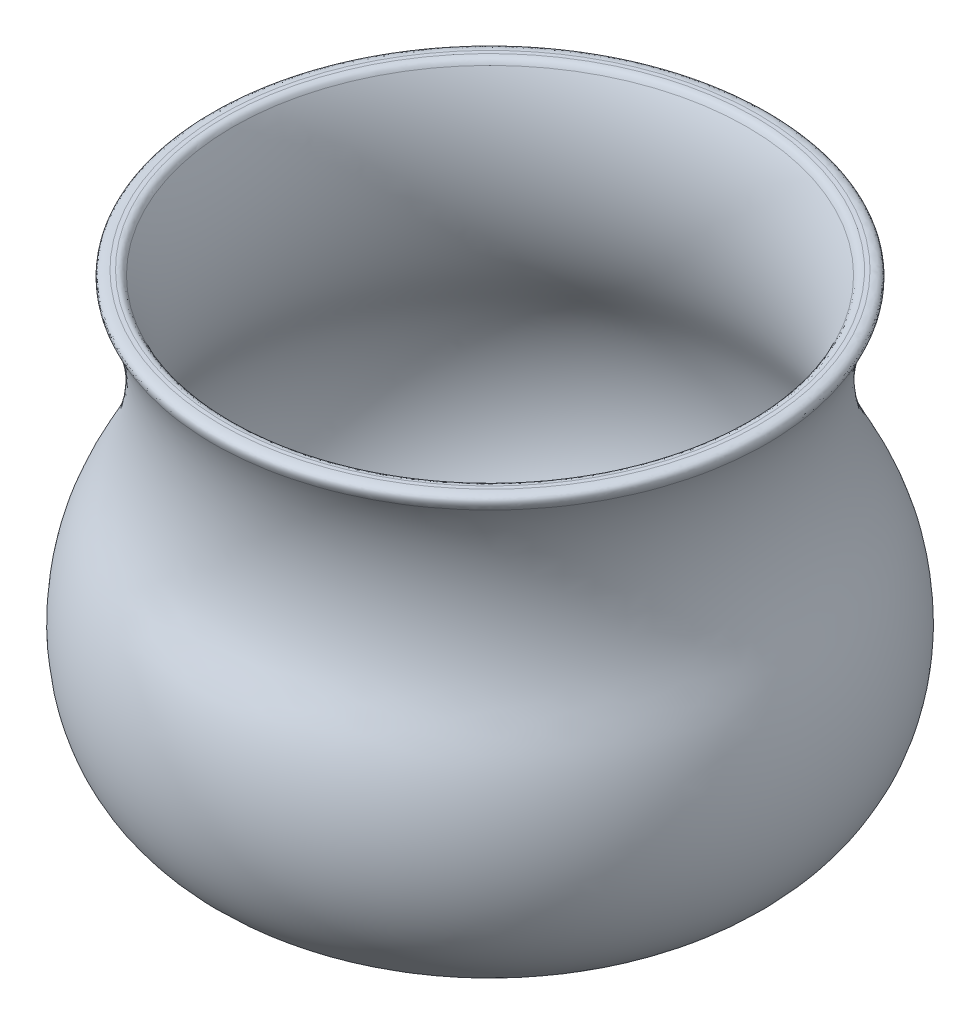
ISO-10303-21;
HEADER;
FILE_DESCRIPTION(('STEP AP214'),'2;1');
FILE_NAME('part.step','',(''),(''),'','','');
FILE_SCHEMA(('AUTOMOTIVE_DESIGN { 1 0 10303 214 1 1 1 1 }'));
ENDSEC;
DATA;
#1=APPLICATION_CONTEXT('core data for automotive mechanical design processes');
#2=APPLICATION_PROTOCOL_DEFINITION('international standard','automotive_design',2000,#1);
#3=PRODUCT_CONTEXT('',#1,'mechanical');
#4=PRODUCT('Part','Part','',(#3));
#5=PRODUCT_RELATED_PRODUCT_CATEGORY('part','',(#4));
#6=PRODUCT_DEFINITION_FORMATION('','',#4);
#7=PRODUCT_DEFINITION_CONTEXT('part definition',#1,'design');
#8=PRODUCT_DEFINITION('design','',#6,#7);
#9=PRODUCT_DEFINITION_SHAPE('','',#8);
#10=(LENGTH_UNIT() NAMED_UNIT(*) SI_UNIT(.MILLI.,.METRE.));
#11=(NAMED_UNIT(*) PLANE_ANGLE_UNIT() SI_UNIT($,.RADIAN.));
#12=(NAMED_UNIT(*) SI_UNIT($,.STERADIAN.) SOLID_ANGLE_UNIT());
#13=UNCERTAINTY_MEASURE_WITH_UNIT(LENGTH_MEASURE(1.E-05),#10,'distance_accuracy_value','');
#14=(GEOMETRIC_REPRESENTATION_CONTEXT(3) GLOBAL_UNCERTAINTY_ASSIGNED_CONTEXT((#13)) GLOBAL_UNIT_ASSIGNED_CONTEXT((#10,
#11,#12)) REPRESENTATION_CONTEXT('',''));
#15=CARTESIAN_POINT('',(0.,0.,0.));
#16=DIRECTION('',(0.,0.,1.));
#17=DIRECTION('',(1.,0.,0.));
#18=AXIS2_PLACEMENT_3D('',#15,#16,#17);
#19=CARTESIAN_POINT('',(-2.59889773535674,17.7798403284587,0.));
#20=CARTESIAN_POINT('',(-3.41804487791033,17.7798418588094,0.));
#21=CARTESIAN_POINT('',(-5.07230125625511,17.7505460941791,0.));
#22=CARTESIAN_POINT('',(-8.2501328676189,17.5837666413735,0.));
#23=CARTESIAN_POINT('',(-12.0715507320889,17.1898060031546,0.));
#24=CARTESIAN_POINT('',(-16.4007658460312,16.4787344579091,0.));
#25=CARTESIAN_POINT('',(-21.8630196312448,15.2934203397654,0.));
#26=CARTESIAN_POINT('',(-28.1522905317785,13.5199401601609,0.));
#27=CARTESIAN_POINT('',(-35.0224513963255,11.388086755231,0.));
#28=CARTESIAN_POINT('',(-41.4078803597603,9.65579886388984,0.));
#29=CARTESIAN_POINT('',(-46.5125739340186,8.80609373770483,0.));
#30=CARTESIAN_POINT('',(-50.60387608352,8.60866084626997,0.));
#31=CARTESIAN_POINT('',(-54.880340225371,8.76169934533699,0.));
#32=CARTESIAN_POINT('',(-59.2432466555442,9.42138384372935,0.));
#33=CARTESIAN_POINT('',(-63.3201399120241,10.5166375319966,0.));
#34=CARTESIAN_POINT('',(-67.0747917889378,11.8603965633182,0.));
#35=CARTESIAN_POINT('',(-71.224968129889,13.9871236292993,0.));
#36=CARTESIAN_POINT('',(-75.433332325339,17.16563538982,0.));
#37=CARTESIAN_POINT('',(-80.1260458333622,22.1689867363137,0.));
#38=CARTESIAN_POINT('',(-84.3963817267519,29.7618481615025,0.));
#39=CARTESIAN_POINT('',(-87.0319074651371,40.4877583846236,0.));
#40=CARTESIAN_POINT('',(-87.1537159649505,50.081833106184,0.));
#41=CARTESIAN_POINT('',(-86.0731256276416,57.6818552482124,0.));
#42=CARTESIAN_POINT('',(-84.6987571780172,63.2298898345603,0.));
#43=CARTESIAN_POINT('',(-83.12055382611,67.6140246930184,0.));
#44=CARTESIAN_POINT('',(-81.597644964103,70.9529731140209,0.));
#45=CARTESIAN_POINT('',(-79.863348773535,74.4015743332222,0.));
#46=CARTESIAN_POINT('',(-77.9359946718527,78.0278609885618,0.));
#47=CARTESIAN_POINT('',(-76.0507539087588,82.0156497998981,0.));
#48=CARTESIAN_POINT('',(-74.3303302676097,86.2588847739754,0.));
#49=CARTESIAN_POINT('',(-72.6471377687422,91.7262697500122,0.));
#50=CARTESIAN_POINT('',(-70.8919716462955,100.791121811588,0.));
#51=CARTESIAN_POINT('',(-70.4966893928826,112.42752007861,0.));
#52=CARTESIAN_POINT('',(-72.6077926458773,123.852833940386,0.));
#53=CARTESIAN_POINT('',(-75.9245220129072,132.446805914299,0.));
#54=CARTESIAN_POINT('',(-78.1616508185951,136.496191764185,0.));
#55=CARTESIAN_POINT('',(-79.4218922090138,138.422639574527,0.));
#56=B_SPLINE_CURVE_WITH_KNOTS('',3,(#19,#20,#21,#22,#23,#24,#25,#26,#27,#28,#29,#30,#31,#32,#33,
#34,#35,#36,#37,#38,#39,#40,#41,#42,#43,#44,#45,#46,#47,#48,#49,#50,#51,#52,#53,#54,#55),
.UNSPECIFIED.,.F.,.F.,(4,1,1,1,1,1,1,1,1,1,1,1,1,1,1,1,1,1,1,1,1,1,1,1,1,1,1,1,1,1,1,1,1,1,4),
(0.0286279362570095,0.0362167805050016,0.0438056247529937,0.058983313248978,0.0741610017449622,
0.0893386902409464,0.119694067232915,0.150049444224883,0.180404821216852,0.21076019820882,
0.225937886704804,0.241115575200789,0.271470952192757,0.286648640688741,0.301826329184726,
0.332181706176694,0.362537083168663,0.392892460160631,0.453603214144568,0.514313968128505,
0.575024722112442,0.60538009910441,0.635735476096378,0.666090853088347,0.681268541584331,
0.696446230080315,0.726801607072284,0.741979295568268,0.757156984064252,0.787512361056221,
0.817867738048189,0.878578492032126,0.939289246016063,0.969644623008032,1.),.UNSPECIFIED.);
#57=CARTESIAN_POINT('',(-2.59889773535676,11.7798403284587,0.));
#58=DIRECTION('',(0.,-1.,0.));
#59=AXIS1_PLACEMENT('',#57,#58);
#60=SURFACE_OF_REVOLUTION('',#56,#59);
#61=CARTESIAN_POINT('',(-2.59889773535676,133.763884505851,0.));
#62=DIRECTION('',(0.,1.,0.));
#63=DIRECTION('',(0.,0.,-1.));
#64=AXIS2_PLACEMENT_3D('',#61,#62,#63);
#65=CIRCLE('',#64,74.1396984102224);
#66=CARTESIAN_POINT('',(-2.59889773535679,133.763884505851,-74.1396984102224));
#67=VERTEX_POINT('',#66);
#68=EDGE_CURVE('E49',#67,#67,#65,.T.);
#69=ORIENTED_EDGE('',*,*,#68,.T.);
#70=EDGE_LOOP('',(#69));
#71=FACE_BOUND('',#70,.T.);
#72=CARTESIAN_POINT('',(-2.59889773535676,17.7798403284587,0.));
#73=VERTEX_POINT('',#72);
#74=VERTEX_LOOP('',#73);
#75=FACE_BOUND('',#74,.T.);
#76=ADVANCED_FACE('F35',(#71,#75),#60,.T.);
#77=CARTESIAN_POINT('',(-84.4431738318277,135.137836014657,0.));
#78=CARTESIAN_POINT('',(-75.1954533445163,121.001513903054,0.));
#79=CARTESIAN_POINT('',(-74.4515854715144,94.7754784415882,0.));
#80=CARTESIAN_POINT('',(-99.1031649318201,54.6230183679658,0.));
#81=CARTESIAN_POINT('',(-92.9540964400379,8.32388203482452,0.));
#82=CARTESIAN_POINT('',(-38.6971228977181,0.0087223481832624,0.));
#83=CARTESIAN_POINT('',(-21.937007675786,11.7798403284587,0.));
#84=CARTESIAN_POINT('',(-2.59889773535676,11.7798403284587,0.));
#85=B_SPLINE_CURVE_WITH_KNOTS('',3,(#77,#78,#79,#80,#81,#82,#83,#84),.UNSPECIFIED.,.F.,.F.,(4,1,
1,1,1,4),(0.0286279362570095,0.28359965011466,0.35927823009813,0.738065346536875,
0.806872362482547,1.),.UNSPECIFIED.);
#86=CARTESIAN_POINT('',(-2.59889773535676,11.7798403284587,0.));
#87=DIRECTION('',(0.,-1.,0.));
#88=AXIS1_PLACEMENT('',#86,#87);
#89=SURFACE_OF_REVOLUTION('',#85,#88);
#90=CARTESIAN_POINT('',(-2.59889773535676,131.487508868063,0.));
#91=DIRECTION('',(0.,-1.,0.));
#92=DIRECTION('',(0.,0.,-1.));
#93=AXIS2_PLACEMENT_3D('',#90,#91,#92);
#94=CIRCLE('',#93,79.7145582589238);
#95=CARTESIAN_POINT('',(-2.59889773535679,131.487508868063,-79.7145582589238));
#96=VERTEX_POINT('',#95);
#97=EDGE_CURVE('E11',#96,#96,#94,.T.);
#98=ORIENTED_EDGE('',*,*,#97,.T.);
#99=EDGE_LOOP('',(#98));
#100=FACE_BOUND('',#99,.T.);
#101=CARTESIAN_POINT('',(-2.59889773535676,11.7798403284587,0.));
#102=VERTEX_POINT('',#101);
#103=VERTEX_LOOP('',#102);
#104=FACE_BOUND('',#103,.T.);
#105=ADVANCED_FACE('F55',(#100,#104),#89,.T.);
#106=CARTESIAN_POINT('',(-84.4431738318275,135.137836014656,0.));
#107=DIRECTION('',(0.,-1.,0.));
#108=DIRECTION('',(0.,0.,-1.));
#109=AXIS2_PLACEMENT_3D('',#106,#107,#108);
#110=PLANE('',#109);
#111=CARTESIAN_POINT('',(-2.59889773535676,135.137836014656,-76.3717411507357));
#112=CARTESIAN_POINT('',(-3.84838875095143,135.137836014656,-76.3717420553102));
#113=CARTESIAN_POINT('',(-5.09785383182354,135.137836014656,-76.3406731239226));
#114=CARTESIAN_POINT('',(-7.59381208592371,135.137836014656,-76.2169967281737));
#115=CARTESIAN_POINT('',(-8.84030507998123,135.137836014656,-76.1243856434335));
#116=CARTESIAN_POINT('',(-11.3273367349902,135.137836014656,-75.8782177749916));
#117=CARTESIAN_POINT('',(-12.5678749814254,135.137836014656,-75.724656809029));
#118=CARTESIAN_POINT('',(-15.0400326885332,135.137836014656,-75.3571799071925));
#119=CARTESIAN_POINT('',(-16.2716517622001,135.137836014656,-75.1432613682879));
#120=CARTESIAN_POINT('',(-18.7230013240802,135.137836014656,-74.6556576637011));
#121=CARTESIAN_POINT('',(-19.9427318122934,135.137836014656,-74.3819724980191));
#122=CARTESIAN_POINT('',(-22.3673355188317,135.137836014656,-73.7754228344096));
#123=CARTESIAN_POINT('',(-23.572209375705,135.137836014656,-73.4425608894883));
#124=CARTESIAN_POINT('',(-25.9641294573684,135.137836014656,-72.7182454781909));
#125=CARTESIAN_POINT('',(-27.1511768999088,135.137836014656,-72.3267960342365));
#126=CARTESIAN_POINT('',(-29.504477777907,135.137836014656,-71.485892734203));
#127=CARTESIAN_POINT('',(-30.670732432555,135.137836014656,-71.0364422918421));
#128=CARTESIAN_POINT('',(-32.9794631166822,135.137836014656,-70.0801347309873));
#129=CARTESIAN_POINT('',(-34.1219391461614,135.137836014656,-69.5732776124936));
#130=CARTESIAN_POINT('',(-36.3805825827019,135.137836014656,-68.5038510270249));
#131=CARTESIAN_POINT('',(-37.4967484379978,135.137836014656,-67.9412782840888));
#132=CARTESIAN_POINT('',(-39.7002596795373,135.137836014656,-66.7621037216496));
#133=CARTESIAN_POINT('',(-40.7876030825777,135.137836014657,-66.1454981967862));
#134=CARTESIAN_POINT('',(-42.9309522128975,135.137836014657,-64.8599398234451));
#135=CARTESIAN_POINT('',(-43.9869565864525,135.137836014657,-64.1909847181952));
#136=CARTESIAN_POINT('',(-46.0651102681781,135.137836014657,-62.8024068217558));
#137=CARTESIAN_POINT('',(-47.0872595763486,135.137836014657,-62.0827840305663));
#138=CARTESIAN_POINT('',(-49.0951848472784,135.137836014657,-60.5945495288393));
#139=CARTESIAN_POINT('',(-50.0809623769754,135.137836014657,-59.8259399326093));
#140=CARTESIAN_POINT('',(-52.0136248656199,135.137836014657,-58.2414115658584));
#141=CARTESIAN_POINT('',(-52.960512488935,135.137836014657,-57.4254960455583));
#142=CARTESIAN_POINT('',(-54.8128792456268,135.137836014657,-55.7480334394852));
#143=CARTESIAN_POINT('',(-55.718360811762,135.137836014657,-54.8864890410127));
#144=CARTESIAN_POINT('',(-57.4853867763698,135.137836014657,-53.1194630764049));
#145=CARTESIAN_POINT('',(-58.3469311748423,135.137836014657,-52.2139815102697));
#146=CARTESIAN_POINT('',(-60.0243937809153,135.137836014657,-50.3616147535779));
#147=CARTESIAN_POINT('',(-60.8403093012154,135.137836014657,-49.4147271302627));
#148=CARTESIAN_POINT('',(-62.4248376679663,135.137836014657,-47.4820646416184));
#149=CARTESIAN_POINT('',(-63.1934472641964,135.137836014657,-46.4962871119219));
#150=CARTESIAN_POINT('',(-64.6816817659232,135.137836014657,-44.488361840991));
#151=CARTESIAN_POINT('',(-65.4013045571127,135.137836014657,-43.4662125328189));
#152=CARTESIAN_POINT('',(-66.7898824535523,135.137836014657,-41.3880588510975));
#153=CARTESIAN_POINT('',(-67.4588375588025,135.137836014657,-40.332054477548));
#154=CARTESIAN_POINT('',(-68.7443959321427,135.137836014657,-38.188705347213));
#155=CARTESIAN_POINT('',(-69.3610014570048,135.137836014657,-37.1013619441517));
#156=CARTESIAN_POINT('',(-70.5401760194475,135.137836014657,-34.8978507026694));
#157=CARTESIAN_POINT('',(-71.1027487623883,135.137836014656,-33.7816848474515));
#158=CARTESIAN_POINT('',(-72.172175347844,135.137836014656,-31.5230414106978));
#159=CARTESIAN_POINT('',(-72.6790324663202,135.137836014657,-30.3805653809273));
#160=CARTESIAN_POINT('',(-73.635340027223,135.137836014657,-28.0718346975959));
#161=CARTESIAN_POINT('',(-74.0847904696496,135.137836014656,-26.9055800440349));
#162=CARTESIAN_POINT('',(-74.9256937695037,135.137836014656,-24.5522791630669));
#163=CARTESIAN_POINT('',(-75.317143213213,135.137836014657,-23.3652317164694));
#164=CARTESIAN_POINT('',(-76.04145862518,135.137836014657,-20.9733116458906));
#165=CARTESIAN_POINT('',(-76.374320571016,135.137836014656,-19.7684378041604));
#166=CARTESIAN_POINT('',(-76.9808702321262,135.137836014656,-17.3438340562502));
#167=CARTESIAN_POINT('',(-77.2545553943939,135.137836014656,-16.124103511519));
#168=CARTESIAN_POINT('',(-77.7421591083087,135.137836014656,-13.6727541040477));
#169=CARTESIAN_POINT('',(-77.9560776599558,135.137836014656,-12.4411352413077));
#170=CARTESIAN_POINT('',(-78.32355452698,135.137836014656,-9.96897695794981));
#171=CARTESIAN_POINT('',(-78.4771154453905,135.137836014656,-8.72843792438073));
#172=CARTESIAN_POINT('',(-78.7232834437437,135.137836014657,-6.24140841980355));
#173=CARTESIAN_POINT('',(-78.815894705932,135.137836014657,-4.99491836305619));
#174=CARTESIAN_POINT('',(-78.9395706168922,135.137836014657,-2.49895208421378));
#175=CARTESIAN_POINT('',(-78.9706388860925,135.137836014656,-1.24947604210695));
#176=CARTESIAN_POINT('',(-78.9706388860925,135.137836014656,1.24947604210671));
#177=CARTESIAN_POINT('',(-78.9395706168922,135.137836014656,2.49895208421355));
#178=CARTESIAN_POINT('',(-78.8158947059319,135.137836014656,4.99491836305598));
#179=CARTESIAN_POINT('',(-78.7232834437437,135.137836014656,6.24140841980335));
#180=CARTESIAN_POINT('',(-78.4771154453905,135.137836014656,8.72843792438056));
#181=CARTESIAN_POINT('',(-78.32355452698,135.137836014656,9.96897695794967));
#182=CARTESIAN_POINT('',(-77.9560776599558,135.137836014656,12.4411352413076));
#183=CARTESIAN_POINT('',(-77.7421591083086,135.137836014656,13.6727541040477));
#184=CARTESIAN_POINT('',(-77.2545553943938,135.137836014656,16.1241035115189));
#185=CARTESIAN_POINT('',(-76.9808702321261,135.137836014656,17.3438340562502));
#186=CARTESIAN_POINT('',(-76.374320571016,135.137836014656,19.7684378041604));
#187=CARTESIAN_POINT('',(-76.0414586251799,135.137836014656,20.9733116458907));
#188=CARTESIAN_POINT('',(-75.3171432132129,135.137836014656,23.3652317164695));
#189=CARTESIAN_POINT('',(-74.9256937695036,135.137836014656,24.5522791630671));
#190=CARTESIAN_POINT('',(-74.0847904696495,135.137836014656,26.9055800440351));
#191=CARTESIAN_POINT('',(-73.6353400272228,135.137836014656,28.0718346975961));
#192=CARTESIAN_POINT('',(-72.6790324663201,135.137836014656,30.3805653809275));
#193=CARTESIAN_POINT('',(-72.1721753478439,135.137836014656,31.523041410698));
#194=CARTESIAN_POINT('',(-71.1027487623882,135.137836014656,33.7816848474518));
#195=CARTESIAN_POINT('',(-70.5401760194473,135.137836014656,34.8978507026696));
#196=CARTESIAN_POINT('',(-69.3610014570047,135.137836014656,37.1013619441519));
#197=CARTESIAN_POINT('',(-68.7443959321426,135.137836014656,38.1887053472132));
#198=CARTESIAN_POINT('',(-67.4588375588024,135.137836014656,40.3320544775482));
#199=CARTESIAN_POINT('',(-66.7898824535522,135.137836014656,41.3880588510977));
#200=CARTESIAN_POINT('',(-65.4013045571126,135.137836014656,43.4662125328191));
#201=CARTESIAN_POINT('',(-64.6816817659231,135.137836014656,44.4883618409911));
#202=CARTESIAN_POINT('',(-63.1934472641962,135.137836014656,46.496287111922));
#203=CARTESIAN_POINT('',(-62.4248376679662,135.137836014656,47.4820646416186));
#204=CARTESIAN_POINT('',(-60.8403093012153,135.137836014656,49.4147271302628));
#205=CARTESIAN_POINT('',(-60.0243937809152,135.137836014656,50.361614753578));
#206=CARTESIAN_POINT('',(-58.3469311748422,135.137836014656,52.2139815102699));
#207=CARTESIAN_POINT('',(-57.4853867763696,135.137836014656,53.119463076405));
#208=CARTESIAN_POINT('',(-55.7183608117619,135.137836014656,54.8864890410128));
#209=CARTESIAN_POINT('',(-54.8128792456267,135.137836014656,55.7480334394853));
#210=CARTESIAN_POINT('',(-52.9605124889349,135.137836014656,57.4254960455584));
#211=CARTESIAN_POINT('',(-52.0136248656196,135.137836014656,58.2414115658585));
#212=CARTESIAN_POINT('',(-50.0809623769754,135.137836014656,59.8259399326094));
#213=CARTESIAN_POINT('',(-49.0951848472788,135.137836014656,60.5945495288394));
#214=CARTESIAN_POINT('',(-47.0872595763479,135.137836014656,62.0827840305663));
#215=CARTESIAN_POINT('',(-46.0651102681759,135.137836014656,62.8024068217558));
#216=CARTESIAN_POINT('',(-43.9869565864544,135.137836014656,64.1909847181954));
#217=CARTESIAN_POINT('',(-42.9309522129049,135.137836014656,64.8599398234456));
#218=CARTESIAN_POINT('',(-40.7876030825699,135.137836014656,66.1454981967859));
#219=CARTESIAN_POINT('',(-39.7002596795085,135.137836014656,66.762103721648));
#220=CARTESIAN_POINT('',(-37.4967484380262,135.137836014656,67.9412782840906));
#221=CARTESIAN_POINT('',(-36.3805825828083,135.137836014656,68.5038510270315));
#222=CARTESIAN_POINT('',(-34.1219391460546,135.137836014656,69.5732776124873));
#223=CARTESIAN_POINT('',(-32.9794631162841,135.137836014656,70.0801347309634));
#224=CARTESIAN_POINT('',(-30.6707324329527,135.137836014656,71.0364422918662));
#225=CARTESIAN_POINT('',(-29.5044777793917,135.137836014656,71.4858927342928));
#226=CARTESIAN_POINT('',(-27.1511768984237,135.137836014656,72.3267960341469));
#227=CARTESIAN_POINT('',(-25.9641294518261,135.137836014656,72.7182454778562));
#228=CARTESIAN_POINT('',(-23.5722093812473,135.137836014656,73.4425608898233));
#229=CARTESIAN_POINT('',(-22.3673355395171,135.137836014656,73.7754228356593));
#230=CARTESIAN_POINT('',(-19.9427317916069,135.137836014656,74.3819724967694));
#231=CARTESIAN_POINT('',(-18.7230012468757,135.137836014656,74.6556576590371));
#232=CARTESIAN_POINT('',(-16.2716518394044,135.137836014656,75.143261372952));
#233=CARTESIAN_POINT('',(-15.0400329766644,135.137836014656,75.3571799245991));
#234=CARTESIAN_POINT('',(-12.5678746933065,135.137836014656,75.7246567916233));
#235=CARTESIAN_POINT('',(-11.3273356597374,135.137836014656,75.8782177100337));
#236=CARTESIAN_POINT('',(-8.84030615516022,135.137836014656,76.1243857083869));
#237=CARTESIAN_POINT('',(-7.59381609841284,135.137836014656,76.2169969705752));
#238=CARTESIAN_POINT('',(-5.09784981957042,135.137836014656,76.3406728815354));
#239=CARTESIAN_POINT('',(-3.84837377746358,135.137836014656,76.3717411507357));
#240=CARTESIAN_POINT('',(-1.34942169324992,135.137836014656,76.3717411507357));
#241=CARTESIAN_POINT('',(-0.0999456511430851,135.137836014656,76.3406728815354));
#242=CARTESIAN_POINT('',(2.39602062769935,135.137836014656,76.2169969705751));
#243=CARTESIAN_POINT('',(3.64251068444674,135.137836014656,76.1243857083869));
#244=CARTESIAN_POINT('',(6.12954018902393,135.137836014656,75.8782177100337));
#245=CARTESIAN_POINT('',(7.37007922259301,135.137836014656,75.7246567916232));
#246=CARTESIAN_POINT('',(9.84223750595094,135.137836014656,75.357179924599));
#247=CARTESIAN_POINT('',(11.073856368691,135.137836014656,75.1432613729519));
#248=CARTESIAN_POINT('',(13.5252057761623,135.137836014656,74.655657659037));
#249=CARTESIAN_POINT('',(14.7449363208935,135.137836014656,74.3819724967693));
#250=CARTESIAN_POINT('',(17.1695400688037,135.137836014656,73.7754228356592));
#251=CARTESIAN_POINT('',(18.374413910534,135.137836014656,73.4425608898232));
#252=CARTESIAN_POINT('',(20.7663339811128,135.137836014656,72.7182454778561));
#253=CARTESIAN_POINT('',(21.9533814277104,135.137836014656,72.3267960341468));
#254=CARTESIAN_POINT('',(24.3066823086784,135.137836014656,71.4858927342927));
#255=CARTESIAN_POINT('',(25.4729369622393,135.137836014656,71.0364422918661));
#256=CARTESIAN_POINT('',(27.7816676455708,135.137836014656,70.0801347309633));
#257=CARTESIAN_POINT('',(28.9241436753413,135.137836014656,69.5732776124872));
#258=CARTESIAN_POINT('',(31.182787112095,135.137836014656,68.5038510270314));
#259=CARTESIAN_POINT('',(32.2989529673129,135.137836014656,67.9412782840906));
#260=CARTESIAN_POINT('',(34.5024642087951,135.137836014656,66.7621037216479));
#261=CARTESIAN_POINT('',(35.5898076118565,135.137836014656,66.1454981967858));
#262=CARTESIAN_POINT('',(37.7331567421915,135.137836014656,64.8599398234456));
#263=CARTESIAN_POINT('',(38.7891611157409,135.137836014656,64.1909847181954));
#264=CARTESIAN_POINT('',(40.8673147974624,135.137836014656,62.8024068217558));
#265=CARTESIAN_POINT('',(41.8894641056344,135.137836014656,62.0827840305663));
#266=CARTESIAN_POINT('',(43.8973893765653,135.137836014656,60.5945495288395));
#267=CARTESIAN_POINT('',(44.8831669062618,135.137836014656,59.8259399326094));
#268=CARTESIAN_POINT('',(46.815829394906,135.137836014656,58.2414115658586));
#269=CARTESIAN_POINT('',(47.7627170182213,135.137836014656,57.4254960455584));
#270=CARTESIAN_POINT('',(49.6150837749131,135.137836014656,55.7480334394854));
#271=CARTESIAN_POINT('',(50.5205653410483,135.137836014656,54.8864890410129));
#272=CARTESIAN_POINT('',(52.287591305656,135.137836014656,53.1194630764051));
#273=CARTESIAN_POINT('',(53.1491357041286,135.137836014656,52.2139815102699));
#274=CARTESIAN_POINT('',(54.8265983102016,135.137836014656,50.3616147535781));
#275=CARTESIAN_POINT('',(55.6425138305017,135.137836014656,49.4147271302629));
#276=CARTESIAN_POINT('',(57.2270421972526,135.137836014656,47.4820646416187));
#277=CARTESIAN_POINT('',(57.9956517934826,135.137836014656,46.4962871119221));
#278=CARTESIAN_POINT('',(59.4838862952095,135.137836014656,44.4883618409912));
#279=CARTESIAN_POINT('',(60.203509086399,135.137836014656,43.4662125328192));
#280=CARTESIAN_POINT('',(61.5920869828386,135.137836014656,41.3880588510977));
#281=CARTESIAN_POINT('',(62.2610420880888,135.137836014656,40.3320544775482));
#282=CARTESIAN_POINT('',(63.5466004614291,135.137836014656,38.1887053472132));
#283=CARTESIAN_POINT('',(64.1632059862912,135.137836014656,37.1013619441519));
#284=CARTESIAN_POINT('',(65.3423805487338,135.137836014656,34.8978507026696));
#285=CARTESIAN_POINT('',(65.9049532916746,135.137836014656,33.7816848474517));
#286=CARTESIAN_POINT('',(66.9743798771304,135.137836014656,31.523041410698));
#287=CARTESIAN_POINT('',(67.4812369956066,135.137836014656,30.3805653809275));
#288=CARTESIAN_POINT('',(68.4375445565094,135.137836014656,28.071834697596));
#289=CARTESIAN_POINT('',(68.886994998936,135.137836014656,26.9055800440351));
#290=CARTESIAN_POINT('',(69.7278982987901,135.137836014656,24.552279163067));
#291=CARTESIAN_POINT('',(70.1193477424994,135.137836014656,23.3652317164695));
#292=CARTESIAN_POINT('',(70.8436631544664,135.137836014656,20.9733116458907));
#293=CARTESIAN_POINT('',(71.1765251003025,135.137836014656,19.7684378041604));
#294=CARTESIAN_POINT('',(71.7830747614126,135.137836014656,17.3438340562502));
#295=CARTESIAN_POINT('',(72.0567599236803,135.137836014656,16.124103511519));
#296=CARTESIAN_POINT('',(72.5443636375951,135.137836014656,13.6727541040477));
#297=CARTESIAN_POINT('',(72.7582821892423,135.137836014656,12.4411352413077));
#298=CARTESIAN_POINT('',(73.1257590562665,135.137836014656,9.96897695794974));
#299=CARTESIAN_POINT('',(73.2793199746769,135.137836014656,8.72843792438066));
#300=CARTESIAN_POINT('',(73.5254879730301,135.137836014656,6.24140841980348));
#301=CARTESIAN_POINT('',(73.6180992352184,135.137836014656,4.9949183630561));
#302=CARTESIAN_POINT('',(73.7417751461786,135.137836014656,2.49895208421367));
#303=CARTESIAN_POINT('',(73.772843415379,135.137836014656,1.24947604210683));
#304=CARTESIAN_POINT('',(73.772843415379,135.137836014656,-1.24947604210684));
#305=CARTESIAN_POINT('',(73.7417751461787,135.137836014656,-2.49895208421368));
#306=CARTESIAN_POINT('',(73.6180992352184,135.137836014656,-4.99491836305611));
#307=CARTESIAN_POINT('',(73.5254879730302,135.137836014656,-6.24140841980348));
#308=CARTESIAN_POINT('',(73.2793199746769,135.137836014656,-8.72843792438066));
#309=CARTESIAN_POINT('',(73.1257590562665,135.137836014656,-9.96897695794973));
#310=CARTESIAN_POINT('',(72.7582821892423,135.137836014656,-12.4411352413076));
#311=CARTESIAN_POINT('',(72.5443636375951,135.137836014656,-13.6727541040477));
#312=CARTESIAN_POINT('',(72.0567599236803,135.137836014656,-16.1241035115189));
#313=CARTESIAN_POINT('',(71.7830747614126,135.137836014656,-17.3438340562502));
#314=CARTESIAN_POINT('',(71.1765251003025,135.137836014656,-19.7684378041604));
#315=CARTESIAN_POINT('',(70.8436631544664,135.137836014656,-20.9733116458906));
#316=CARTESIAN_POINT('',(70.1193477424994,135.137836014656,-23.3652317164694));
#317=CARTESIAN_POINT('',(69.7278982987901,135.137836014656,-24.552279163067));
#318=CARTESIAN_POINT('',(68.886994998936,135.137836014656,-26.905580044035));
#319=CARTESIAN_POINT('',(68.4375445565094,135.137836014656,-28.071834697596));
#320=CARTESIAN_POINT('',(67.4812369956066,135.137836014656,-30.3805653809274));
#321=CARTESIAN_POINT('',(66.9743798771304,135.137836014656,-31.5230414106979));
#322=CARTESIAN_POINT('',(65.9049532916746,135.137836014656,-33.7816848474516));
#323=CARTESIAN_POINT('',(65.3423805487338,135.137836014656,-34.8978507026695));
#324=CARTESIAN_POINT('',(64.1632059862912,135.137836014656,-37.1013619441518));
#325=CARTESIAN_POINT('',(63.5466004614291,135.137836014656,-38.1887053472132));
#326=CARTESIAN_POINT('',(62.2610420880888,135.137836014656,-40.3320544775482));
#327=CARTESIAN_POINT('',(61.5920869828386,135.137836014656,-41.3880588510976));
#328=CARTESIAN_POINT('',(60.203509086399,135.137836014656,-43.4662125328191));
#329=CARTESIAN_POINT('',(59.4838862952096,135.137836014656,-44.4883618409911));
#330=CARTESIAN_POINT('',(57.9956517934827,135.137836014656,-46.4962871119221));
#331=CARTESIAN_POINT('',(57.2270421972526,135.137836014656,-47.4820646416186));
#332=CARTESIAN_POINT('',(55.6425138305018,135.137836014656,-49.4147271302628));
#333=CARTESIAN_POINT('',(54.8265983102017,135.137836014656,-50.3616147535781));
#334=CARTESIAN_POINT('',(53.1491357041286,135.137836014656,-52.2139815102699));
#335=CARTESIAN_POINT('',(52.2875913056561,135.137836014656,-53.1194630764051));
#336=CARTESIAN_POINT('',(50.5205653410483,135.137836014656,-54.8864890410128));
#337=CARTESIAN_POINT('',(49.6150837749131,135.137836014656,-55.7480334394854));
#338=CARTESIAN_POINT('',(47.7627170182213,135.137836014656,-57.4254960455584));
#339=CARTESIAN_POINT('',(46.8158293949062,135.137836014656,-58.2414115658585));
#340=CARTESIAN_POINT('',(44.8831669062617,135.137836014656,-59.8259399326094));
#341=CARTESIAN_POINT('',(43.8973893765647,135.137836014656,-60.5945495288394));
#342=CARTESIAN_POINT('',(41.8894641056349,135.137836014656,-62.0827840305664));
#343=CARTESIAN_POINT('',(40.8673147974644,135.137836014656,-62.8024068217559));
#344=CARTESIAN_POINT('',(38.7891611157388,135.137836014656,-64.1909847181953));
#345=CARTESIAN_POINT('',(37.7331567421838,135.137836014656,-64.8599398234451));
#346=CARTESIAN_POINT('',(35.5898076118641,135.137836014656,-66.1454981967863));
#347=CARTESIAN_POINT('',(34.5024642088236,135.137836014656,-66.7621037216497));
#348=CARTESIAN_POINT('',(32.2989529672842,135.137836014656,-67.9412782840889));
#349=CARTESIAN_POINT('',(31.1827871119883,135.137836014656,-68.503851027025));
#350=CARTESIAN_POINT('',(28.9241436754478,135.137836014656,-69.5732776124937));
#351=CARTESIAN_POINT('',(27.7816676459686,135.137836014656,-70.0801347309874));
#352=CARTESIAN_POINT('',(25.4729369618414,135.137836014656,-71.0364422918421));
#353=CARTESIAN_POINT('',(24.3066823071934,135.137836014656,-71.4858927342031));
#354=CARTESIAN_POINT('',(21.9533814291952,135.137836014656,-72.3267960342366));
#355=CARTESIAN_POINT('',(20.7663339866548,135.137836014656,-72.718245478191));
#356=CARTESIAN_POINT('',(18.3744139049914,135.137836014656,-73.4425608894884));
#357=CARTESIAN_POINT('',(17.1695400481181,135.137836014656,-73.7754228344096));
#358=CARTESIAN_POINT('',(14.7449363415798,135.137836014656,-74.3819724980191));
#359=CARTESIAN_POINT('',(13.5252058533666,135.137836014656,-74.6556576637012));
#360=CARTESIAN_POINT('',(11.0738562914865,135.137836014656,-75.1432613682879));
#361=CARTESIAN_POINT('',(9.84223721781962,135.137836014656,-75.3571799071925));
#362=CARTESIAN_POINT('',(7.37007951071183,135.137836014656,-75.724656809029));
#363=CARTESIAN_POINT('',(6.1295412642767,135.137836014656,-75.8782177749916));
#364=CARTESIAN_POINT('',(3.64250960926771,135.137836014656,-76.1243856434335));
#365=CARTESIAN_POINT('',(2.39601661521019,135.137836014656,-76.2169967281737));
#366=CARTESIAN_POINT('',(-0.0999416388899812,135.137836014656,-76.3406731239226));
#367=CARTESIAN_POINT('',(-1.34940671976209,135.137836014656,-76.3717420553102));
#368=CARTESIAN_POINT('',(-2.59889773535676,135.137836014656,-76.3717411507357));
#369=B_SPLINE_CURVE_WITH_KNOTS('',3,(#111,#112,#113,#114,#115,#116,#117,#118,#119,#120,#121,
#122,#123,#124,#125,#126,#127,#128,#129,#130,#131,#132,#133,#134,#135,#136,#137,#138,#139,#140,
#141,#142,#143,#144,#145,#146,#147,#148,#149,#150,#151,#152,#153,#154,#155,#156,#157,#158,#159,
#160,#161,#162,#163,#164,#165,#166,#167,#168,#169,#170,#171,#172,#173,#174,#175,#176,#177,#178,
#179,#180,#181,#182,#183,#184,#185,#186,#187,#188,#189,#190,#191,#192,#193,#194,#195,#196,#197,
#198,#199,#200,#201,#202,#203,#204,#205,#206,#207,#208,#209,#210,#211,#212,#213,#214,#215,#216,
#217,#218,#219,#220,#221,#222,#223,#224,#225,#226,#227,#228,#229,#230,#231,#232,#233,#234,#235,
#236,#237,#238,#239,#240,#241,#242,#243,#244,#245,#246,#247,#248,#249,#250,#251,#252,#253,#254,
#255,#256,#257,#258,#259,#260,#261,#262,#263,#264,#265,#266,#267,#268,#269,#270,#271,#272,#273,
#274,#275,#276,#277,#278,#279,#280,#281,#282,#283,#284,#285,#286,#287,#288,#289,#290,#291,#292,
#293,#294,#295,#296,#297,#298,#299,#300,#301,#302,#303,#304,#305,#306,#307,#308,#309,#310,#311,
#312,#313,#314,#315,#316,#317,#318,#319,#320,#321,#322,#323,#324,#325,#326,#327,#328,#329,#330,
#331,#332,#333,#334,#335,#336,#337,#338,#339,#340,#341,#342,#343,#344,#345,#346,#347,#348,#349,
#350,#351,#352,#353,#354,#355,#356,#357,#358,#359,#360,#361,#362,#363,#364,#365,#366,#367,#368),
.UNSPECIFIED.,.F.,.F.,(4,2,2,2,2,2,2,2,2,2,2,2,2,2,2,2,2,2,2,2,2,2,2,2,2,2,2,2,2,2,2,2,2,2,2,2,
2,2,2,2,2,2,2,2,2,2,2,2,2,2,2,2,2,2,2,2,2,2,2,2,2,2,2,2,2,2,2,2,2,2,2,2,2,2,2,2,2,2,2,2,2,2,2,2,
2,2,2,2,2,2,2,2,2,2,2,2,2,2,2,2,2,2,2,2,2,2,2,2,2,2,2,2,2,2,2,2,2,2,2,2,2,2,2,2,2,2,2,2,4),(0.,
3.74805011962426,7.49632074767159,11.2448486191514,14.9935381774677,18.7422277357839,
22.4907556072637,26.239026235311,29.9870763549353,33.7351264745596,37.483397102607,
41.2319249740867,44.980614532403,48.7293040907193,52.4778319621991,56.2261025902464,
59.9741527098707,63.7222028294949,67.4704734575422,71.219001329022,74.9676908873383,
78.7163804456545,82.4649083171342,86.2131789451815,89.9612290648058,93.7092791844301,
97.4575498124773,101.206077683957,104.954767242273,108.703456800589,112.451984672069,
116.200255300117,119.948305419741,123.696355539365,127.444626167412,131.193154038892,
134.941843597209,138.690533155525,142.439061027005,146.187331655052,149.935381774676,
153.6834318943,157.431702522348,161.180230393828,164.928919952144,168.67760951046,
172.42613738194,176.174408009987,179.922458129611,183.670508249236,187.418778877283,
191.167306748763,194.915996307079,198.664685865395,202.413213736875,206.161484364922,
209.909534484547,213.657584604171,217.405855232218,221.154383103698,224.903072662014,
228.651762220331,232.40029009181,236.148560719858,239.896610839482,243.644660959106,
247.392931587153,251.141459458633,254.890149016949,258.638838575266,262.387366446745,
266.135637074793,269.883687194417,273.631737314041,277.380007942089,281.128535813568,
284.877225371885,288.625914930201,292.374442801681,296.122713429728,299.870763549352,
303.618813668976,307.367084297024,311.115612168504,314.86430172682,318.612991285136,
322.361519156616,326.109789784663,329.857839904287,333.605890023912,337.354160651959,
341.102688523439,344.851378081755,348.600067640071,352.348595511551,356.096866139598,
359.844916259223,363.592966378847,367.341237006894,371.089764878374,374.83845443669,
378.587143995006,382.335671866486,386.083942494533,389.831992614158,393.580042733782,
397.328313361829,401.076841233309,404.825530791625,408.574220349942,412.322748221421,
416.071018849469,419.819068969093,423.567119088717,427.315389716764,431.063917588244,
434.81260714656,438.561296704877,442.309824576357,446.058095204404,449.806145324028,
453.554195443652,457.3024660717,461.050993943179,464.799683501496,468.548373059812,
472.296900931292,476.045171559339,479.793221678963),.UNSPECIFIED.);
#370=CARTESIAN_POINT('',(-2.59889773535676,135.137836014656,-76.3717411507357));
#371=VERTEX_POINT('',#370);
#372=EDGE_CURVE('E101',#371,#371,#369,.F.);
#373=ORIENTED_EDGE('',*,*,#372,.T.);
#374=EDGE_LOOP('',(#373));
#375=FACE_BOUND('',#374,.T.);
#376=CARTESIAN_POINT('',(-2.59889773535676,135.137836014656,-77.4949304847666));
#377=CARTESIAN_POINT('',(2.47309152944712,135.137836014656,-77.4949304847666));
#378=CARTESIAN_POINT('',(12.6170700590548,135.137836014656,-76.4958358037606));
#379=CARTESIAN_POINT('',(27.2482967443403,135.137836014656,-72.057501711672));
#380=CARTESIAN_POINT('',(40.7325124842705,135.137836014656,-64.8500382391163));
#381=CARTESIAN_POINT('',(52.5515264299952,135.137836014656,-55.1504241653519));
#382=CARTESIAN_POINT('',(62.2511405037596,135.137836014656,-43.3314102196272));
#383=CARTESIAN_POINT('',(69.4586039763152,135.137836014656,-29.847194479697));
#384=CARTESIAN_POINT('',(73.8969380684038,135.137836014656,-15.2159677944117));
#385=CARTESIAN_POINT('',(75.3955800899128,135.137836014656,0.));
#386=CARTESIAN_POINT('',(73.8969380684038,135.137836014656,15.2159677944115));
#387=CARTESIAN_POINT('',(69.4586039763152,135.137836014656,29.8471944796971));
#388=CARTESIAN_POINT('',(62.2511405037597,135.137836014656,43.3314102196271));
#389=CARTESIAN_POINT('',(52.5515264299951,135.137836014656,55.150424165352));
#390=CARTESIAN_POINT('',(40.7325124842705,135.137836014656,64.8500382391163));
#391=CARTESIAN_POINT('',(27.2482967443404,135.137836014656,72.057501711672));
#392=CARTESIAN_POINT('',(12.6170700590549,135.137836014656,76.4958358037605));
#393=CARTESIAN_POINT('',(-2.59889773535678,135.137836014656,77.9944778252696));
#394=CARTESIAN_POINT('',(-17.8148655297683,135.137836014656,76.4958358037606));
#395=CARTESIAN_POINT('',(-32.4460922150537,135.137836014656,72.057501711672));
#396=CARTESIAN_POINT('',(-45.9303079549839,135.137836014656,64.8500382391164));
#397=CARTESIAN_POINT('',(-57.7493219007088,135.137836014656,55.1504241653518));
#398=CARTESIAN_POINT('',(-67.448935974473,135.137836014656,43.3314102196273));
#399=CARTESIAN_POINT('',(-74.6563994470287,135.137836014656,29.8471944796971));
#400=CARTESIAN_POINT('',(-79.0947335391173,135.137836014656,15.2159677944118));
#401=CARTESIAN_POINT('',(-80.5933755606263,135.137836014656,-2.87997131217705E-13));
#402=CARTESIAN_POINT('',(-79.0947335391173,135.137836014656,-15.2159677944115));
#403=CARTESIAN_POINT('',(-74.6563994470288,135.137836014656,-29.8471944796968));
#404=CARTESIAN_POINT('',(-67.448935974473,135.137836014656,-43.3314102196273));
#405=CARTESIAN_POINT('',(-57.7493219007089,135.137836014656,-55.1504241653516));
#406=CARTESIAN_POINT('',(-45.930307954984,135.137836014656,-64.8500382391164));
#407=CARTESIAN_POINT('',(-32.4460922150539,135.137836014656,-72.0575017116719));
#408=CARTESIAN_POINT('',(-17.8148655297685,135.137836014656,-76.4958358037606));
#409=CARTESIAN_POINT('',(-7.67088700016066,135.137836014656,-77.4949304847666));
#410=CARTESIAN_POINT('',(-2.59889773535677,135.137836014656,-77.4949304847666));
#411=B_SPLINE_CURVE_WITH_KNOTS('',3,(#376,#377,#378,#379,#380,#381,#382,#383,#384,#385,#386,
#387,#388,#389,#390,#391,#392,#393,#394,#395,#396,#397,#398,#399,#400,#401,#402,#403,#404,#405,
#406,#407,#408,#409,#410),.UNSPECIFIED.,.T.,.F.,(4,1,1,1,1,1,1,1,1,1,1,1,1,1,1,1,1,1,1,1,1,1,1,
1,1,1,1,1,1,1,1,1,4),(0.,0.196349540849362,0.392699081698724,0.589048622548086,
0.785398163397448,0.98174770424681,1.17809724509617,1.37444678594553,1.5707963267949,
1.76714586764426,1.96349540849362,2.15984494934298,2.35619449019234,2.55254403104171,
2.74889357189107,2.94524311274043,3.14159265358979,3.33794219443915,3.53429173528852,
3.73064127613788,3.92699081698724,4.1233403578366,4.31968989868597,4.51603943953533,
4.71238898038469,4.90873852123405,5.10508806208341,5.30143760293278,5.49778714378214,
5.6941366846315,5.89048622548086,6.08683576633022,6.28318530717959),.UNSPECIFIED.);
#412=CARTESIAN_POINT('',(-2.59889773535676,135.137836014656,-77.4949304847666));
#413=VERTEX_POINT('',#412);
#414=EDGE_CURVE('E89',#413,#413,#411,.F.);
#415=ORIENTED_EDGE('',*,*,#414,.T.);
#416=EDGE_LOOP('',(#415));
#417=FACE_BOUND('',#416,.T.);
#418=ADVANCED_FACE('F57',(#375,#417),#110,.F.);
#419=CARTESIAN_POINT('',(-2.59889773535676,135.137836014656,-76.3717411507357));
#420=CARTESIAN_POINT('',(7.396794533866,135.137836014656,-76.3717411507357));
#421=CARTESIAN_POINT('',(27.3881790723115,135.137836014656,-72.3952075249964));
#422=CARTESIAN_POINT('',(52.8099952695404,135.137836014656,-55.4088930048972));
#423=CARTESIAN_POINT('',(69.7963097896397,135.137836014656,-29.9870768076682));
#424=CARTESIAN_POINT('',(75.7611102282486,135.137836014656,0.));
#425=CARTESIAN_POINT('',(69.7963097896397,135.137836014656,29.9870768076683));
#426=CARTESIAN_POINT('',(52.8099952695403,135.137836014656,55.4088930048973));
#427=CARTESIAN_POINT('',(27.3881790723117,135.137836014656,72.3952075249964));
#428=CARTESIAN_POINT('',(-2.59889773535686,135.137836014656,78.3600079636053));
#429=CARTESIAN_POINT('',(-32.5859745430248,135.137836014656,72.3952075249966));
#430=CARTESIAN_POINT('',(-58.0077907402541,135.137836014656,55.4088930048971));
#431=CARTESIAN_POINT('',(-74.9941052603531,135.137836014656,29.9870768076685));
#432=CARTESIAN_POINT('',(-80.9589056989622,135.137836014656,-3.21864900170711E-13));
#433=CARTESIAN_POINT('',(-74.9941052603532,135.137836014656,-29.987076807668));
#434=CARTESIAN_POINT('',(-58.0077907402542,135.137836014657,-55.4088930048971));
#435=CARTESIAN_POINT('',(-32.5859745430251,135.137836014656,-72.3952075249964));
#436=CARTESIAN_POINT('',(-12.5945900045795,135.137836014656,-76.3717411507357));
#437=CARTESIAN_POINT('',(-2.59889773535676,135.137836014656,-76.3717411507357));
#438=CARTESIAN_POINT('',(-2.59889773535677,135.137836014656,-76.0970746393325));
#439=CARTESIAN_POINT('',(7.36084560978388,135.137836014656,-76.0970746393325));
#440=CARTESIAN_POINT('',(27.2803323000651,135.137836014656,-72.1348423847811));
#441=CARTESIAN_POINT('',(52.6107204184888,135.137836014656,-55.2096181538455));
#442=CARTESIAN_POINT('',(69.5359446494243,135.137836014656,-29.8792300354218));
#443=CARTESIAN_POINT('',(75.4792930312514,135.137836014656,0.));
#444=CARTESIAN_POINT('',(69.5359446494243,135.137836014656,29.8792300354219));
#445=CARTESIAN_POINT('',(52.6107204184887,135.137836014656,55.2096181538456));
#446=CARTESIAN_POINT('',(27.2803323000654,135.137836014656,72.134842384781));
#447=CARTESIAN_POINT('',(-2.59889773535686,135.137836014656,78.0781907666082));
#448=CARTESIAN_POINT('',(-32.4781277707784,135.137836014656,72.1348423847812));
#449=CARTESIAN_POINT('',(-57.8085158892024,135.137836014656,55.2096181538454));
#450=CARTESIAN_POINT('',(-74.7337401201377,135.137836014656,29.8792300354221));
#451=CARTESIAN_POINT('',(-80.677088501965,135.137836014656,-3.19304873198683E-13));
#452=CARTESIAN_POINT('',(-74.7337401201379,135.137836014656,-29.8792300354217));
#453=CARTESIAN_POINT('',(-57.8085158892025,135.137836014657,-55.2096181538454));
#454=CARTESIAN_POINT('',(-32.4781277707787,135.137836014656,-72.1348423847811));
#455=CARTESIAN_POINT('',(-12.5586410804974,135.137836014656,-76.0970746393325));
#456=CARTESIAN_POINT('',(-2.59889773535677,135.137836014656,-76.0970746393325));
#457=CARTESIAN_POINT('',(-2.59889773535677,135.137836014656,-75.8224081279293));
#458=CARTESIAN_POINT('',(7.32489668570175,135.137836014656,-75.8224081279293));
#459=CARTESIAN_POINT('',(27.1724855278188,135.137836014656,-71.8744772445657));
#460=CARTESIAN_POINT('',(52.411445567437,135.137836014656,-55.0103433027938));
#461=CARTESIAN_POINT('',(69.275579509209,135.137836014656,-29.7713832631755));
#462=CARTESIAN_POINT('',(75.1974758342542,135.137836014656,0.));
#463=CARTESIAN_POINT('',(69.2755795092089,135.137836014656,29.7713832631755));
#464=CARTESIAN_POINT('',(52.411445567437,135.137836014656,55.0103433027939));
#465=CARTESIAN_POINT('',(27.172485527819,135.137836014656,71.8744772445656));
#466=CARTESIAN_POINT('',(-2.59889773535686,135.137836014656,77.796373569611));
#467=CARTESIAN_POINT('',(-32.370280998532,135.137836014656,71.8744772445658));
#468=CARTESIAN_POINT('',(-57.6092410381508,135.137836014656,55.0103433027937));
#469=CARTESIAN_POINT('',(-74.4733749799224,135.137836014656,29.7713832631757));
#470=CARTESIAN_POINT('',(-80.3952713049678,135.137836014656,-3.20928206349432E-13));
#471=CARTESIAN_POINT('',(-74.4733749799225,135.137836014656,-29.7713832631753));
#472=CARTESIAN_POINT('',(-57.6092410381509,135.137836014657,-55.0103433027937));
#473=CARTESIAN_POINT('',(-32.3702809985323,135.137836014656,-71.8744772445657));
#474=CARTESIAN_POINT('',(-12.5226921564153,135.137836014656,-75.8224081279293));
#475=CARTESIAN_POINT('',(-2.59889773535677,135.137836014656,-75.8224081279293));
#476=CARTESIAN_POINT('',(-2.59889773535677,135.060660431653,-75.2070098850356));
#477=CARTESIAN_POINT('',(7.24435208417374,135.060660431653,-75.2070098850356));
#478=CARTESIAN_POINT('',(26.9308517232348,135.060660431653,-71.2911216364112));
#479=CARTESIAN_POINT('',(51.9649645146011,135.060660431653,-54.5638622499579));
#480=CARTESIAN_POINT('',(68.6922239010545,135.060660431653,-29.5297494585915));
#481=CARTESIAN_POINT('',(74.566056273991,135.060660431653,0.));
#482=CARTESIAN_POINT('',(68.6922239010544,135.060660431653,29.5297494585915));
#483=CARTESIAN_POINT('',(51.964964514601,135.060660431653,54.5638622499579));
#484=CARTESIAN_POINT('',(26.930851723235,135.060660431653,71.2911216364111));
#485=CARTESIAN_POINT('',(-2.59889773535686,135.060660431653,77.1649540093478));
#486=CARTESIAN_POINT('',(-32.128647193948,135.060660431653,71.2911216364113));
#487=CARTESIAN_POINT('',(-57.1627599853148,135.060660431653,54.5638622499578));
#488=CARTESIAN_POINT('',(-73.8900193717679,135.060660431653,29.5297494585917));
#489=CARTESIAN_POINT('',(-79.7638517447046,135.060660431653,-3.15872888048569E-13));
#490=CARTESIAN_POINT('',(-73.890019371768,135.060660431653,-29.5297494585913));
#491=CARTESIAN_POINT('',(-57.1627599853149,135.060660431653,-54.5638622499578));
#492=CARTESIAN_POINT('',(-32.1286471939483,135.060660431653,-71.2911216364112));
#493=CARTESIAN_POINT('',(-12.4421475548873,135.060660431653,-75.2070098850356));
#494=CARTESIAN_POINT('',(-2.59889773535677,135.060660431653,-75.2070098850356));
#495=CARTESIAN_POINT('',(-2.59889773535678,134.765275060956,-74.732325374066));
#496=CARTESIAN_POINT('',(7.18222438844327,134.765275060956,-74.732325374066));
#497=CARTESIAN_POINT('',(26.7444686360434,134.765275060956,-70.8411530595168));
#498=CARTESIAN_POINT('',(51.6205734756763,134.765275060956,-54.2194712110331));
#499=CARTESIAN_POINT('',(68.2422553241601,134.765275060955,-29.3433663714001));
#500=CARTESIAN_POINT('',(74.0790137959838,134.765275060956,0.));
#501=CARTESIAN_POINT('',(68.24225532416,134.765275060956,29.3433663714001));
#502=CARTESIAN_POINT('',(51.6205734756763,134.765275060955,54.2194712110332));
#503=CARTESIAN_POINT('',(26.7444686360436,134.765275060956,70.8411530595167));
#504=CARTESIAN_POINT('',(-2.59889773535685,134.765275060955,76.6779115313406));
#505=CARTESIAN_POINT('',(-31.9422641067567,134.765275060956,70.8411530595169));
#506=CARTESIAN_POINT('',(-56.81836894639,134.765275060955,54.219471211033));
#507=CARTESIAN_POINT('',(-73.4400507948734,134.765275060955,29.3433663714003));
#508=CARTESIAN_POINT('',(-79.2768092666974,134.765275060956,-3.1831645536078E-13));
#509=CARTESIAN_POINT('',(-73.4400507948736,134.765275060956,-29.3433663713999));
#510=CARTESIAN_POINT('',(-56.8183689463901,134.765275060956,-54.219471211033));
#511=CARTESIAN_POINT('',(-31.9422641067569,134.765275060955,-70.8411530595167));
#512=CARTESIAN_POINT('',(-12.3800198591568,134.765275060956,-74.732325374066));
#513=CARTESIAN_POINT('',(-2.59889773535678,134.765275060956,-74.732325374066));
#514=CARTESIAN_POINT('',(-2.59889773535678,134.26093235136,-74.3926591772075));
#515=CARTESIAN_POINT('',(7.13776817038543,134.26093235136,-74.3926591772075));
#516=CARTESIAN_POINT('',(26.6110999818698,134.26093235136,-70.5191726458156));
#517=CARTESIAN_POINT('',(51.3741403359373,134.26093235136,-53.9730380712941));
#518=CARTESIAN_POINT('',(67.9202749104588,134.26093235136,-29.2099977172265));
#519=CARTESIAN_POINT('',(73.7305047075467,134.26093235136,0.));
#520=CARTESIAN_POINT('',(67.9202749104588,134.26093235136,29.2099977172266));
#521=CARTESIAN_POINT('',(51.3741403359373,134.26093235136,53.9730380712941));
#522=CARTESIAN_POINT('',(26.61109998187,134.26093235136,70.5191726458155));
#523=CARTESIAN_POINT('',(-2.59889773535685,134.26093235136,76.3294024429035));
#524=CARTESIAN_POINT('',(-31.8088954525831,134.26093235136,70.5191726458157));
#525=CARTESIAN_POINT('',(-56.571935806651,134.26093235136,53.973038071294));
#526=CARTESIAN_POINT('',(-73.1180703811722,134.26093235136,29.2099977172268));
#527=CARTESIAN_POINT('',(-78.9283001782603,134.26093235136,-3.08173206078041E-13));
#528=CARTESIAN_POINT('',(-73.1180703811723,134.26093235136,-29.2099977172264));
#529=CARTESIAN_POINT('',(-56.5719358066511,134.26093235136,-53.9730380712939));
#530=CARTESIAN_POINT('',(-31.8088954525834,134.26093235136,-70.5191726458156));
#531=CARTESIAN_POINT('',(-12.335563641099,134.26093235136,-74.3926591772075));
#532=CARTESIAN_POINT('',(-2.59889773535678,134.26093235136,-74.3926591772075));
#533=CARTESIAN_POINT('',(-2.59889773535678,134.013737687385,-74.2657474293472));
#534=CARTESIAN_POINT('',(7.12115769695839,134.013737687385,-74.2657474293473));
#535=CARTESIAN_POINT('',(26.5612685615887,134.013737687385,-70.3988689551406));
#536=CARTESIAN_POINT('',(51.28206387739,134.013737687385,-53.8809616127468));
#537=CARTESIAN_POINT('',(67.7999712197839,134.013737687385,-29.1601662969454));
#538=CARTESIAN_POINT('',(73.6002889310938,134.013737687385,0.));
#539=CARTESIAN_POINT('',(67.7999712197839,134.013737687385,29.1601662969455));
#540=CARTESIAN_POINT('',(51.2820638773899,134.013737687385,53.8809616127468));
#541=CARTESIAN_POINT('',(26.5612685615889,134.013737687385,70.3988689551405));
#542=CARTESIAN_POINT('',(-2.59889773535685,134.013737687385,76.1991866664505));
#543=CARTESIAN_POINT('',(-31.759064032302,134.013737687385,70.3988689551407));
#544=CARTESIAN_POINT('',(-56.4798593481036,134.013737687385,53.8809616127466));
#545=CARTESIAN_POINT('',(-72.9977666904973,134.013737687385,29.1601662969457));
#546=CARTESIAN_POINT('',(-78.7980844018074,134.013737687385,-3.07380419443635E-13));
#547=CARTESIAN_POINT('',(-72.9977666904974,134.013737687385,-29.1601662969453));
#548=CARTESIAN_POINT('',(-56.4798593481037,134.013737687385,-53.8809616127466));
#549=CARTESIAN_POINT('',(-31.7590640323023,134.013737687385,-70.3988689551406));
#550=CARTESIAN_POINT('',(-12.3189531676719,134.013737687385,-74.2657474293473));
#551=CARTESIAN_POINT('',(-2.59889773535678,134.013737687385,-74.2657474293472));
#552=CARTESIAN_POINT('',(-2.59889773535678,133.763884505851,-74.1396984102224));
#553=CARTESIAN_POINT('',(7.10466013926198,133.763884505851,-74.1396984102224));
#554=CARTESIAN_POINT('',(26.5117758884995,133.763884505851,-70.2793830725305));
#555=CARTESIAN_POINT('',(51.1906133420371,133.763884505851,-53.7895110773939));
#556=CARTESIAN_POINT('',(67.6804853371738,133.763884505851,-29.1106736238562));
#557=CARTESIAN_POINT('',(73.4709583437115,133.763884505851,0.));
#558=CARTESIAN_POINT('',(67.6804853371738,133.763884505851,29.1106736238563));
#559=CARTESIAN_POINT('',(51.1906133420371,133.763884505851,53.789511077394));
#560=CARTESIAN_POINT('',(26.5117758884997,133.763884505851,70.2793830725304));
#561=CARTESIAN_POINT('',(-2.59889773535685,133.763884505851,76.0698560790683));
#562=CARTESIAN_POINT('',(-31.7095713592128,133.763884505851,70.2793830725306));
#563=CARTESIAN_POINT('',(-56.3884088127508,133.763884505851,53.7895110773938));
#564=CARTESIAN_POINT('',(-72.8782808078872,133.763884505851,29.1106736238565));
#565=CARTESIAN_POINT('',(-78.6687538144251,133.763884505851,-3.0528063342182E-13));
#566=CARTESIAN_POINT('',(-72.8782808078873,133.763884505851,-29.110673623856));
#567=CARTESIAN_POINT('',(-56.3884088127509,133.763884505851,-53.7895110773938));
#568=CARTESIAN_POINT('',(-31.7095713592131,133.763884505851,-70.2793830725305));
#569=CARTESIAN_POINT('',(-12.3024556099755,133.763884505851,-74.1396984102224));
#570=CARTESIAN_POINT('',(-2.59889773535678,133.763884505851,-74.1396984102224));
#571=B_SPLINE_SURFACE_WITH_KNOTS('',5,3,((#419,#420,#421,#422,#423,#424,#425,#426,#427,#428,
#429,#430,#431,#432,#433,#434,#435,#436,#437),(#438,#439,#440,#441,#442,#443,#444,#445,#446,
#447,#448,#449,#450,#451,#452,#453,#454,#455,#456),(#457,#458,#459,#460,#461,#462,#463,#464,
#465,#466,#467,#468,#469,#470,#471,#472,#473,#474,#475),(#476,#477,#478,#479,#480,#481,#482,
#483,#484,#485,#486,#487,#488,#489,#490,#491,#492,#493,#494),(#495,#496,#497,#498,#499,#500,
#501,#502,#503,#504,#505,#506,#507,#508,#509,#510,#511,#512,#513),(#514,#515,#516,#517,#518,
#519,#520,#521,#522,#523,#524,#525,#526,#527,#528,#529,#530,#531,#532),(#533,#534,#535,#536,
#537,#538,#539,#540,#541,#542,#543,#544,#545,#546,#547,#548,#549,#550,#551),(#552,#553,#554,
#555,#556,#557,#558,#559,#560,#561,#562,#563,#564,#565,#566,#567,#568,#569,#570)),.UNSPECIFIED.,
.F.,.T.,.F.,(6,2,6),(4,1,1,1,1,1,1,1,1,1,1,1,1,1,1,1,4),(0.,0.5,1.),(0.,0.392699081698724,
0.785398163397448,1.17809724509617,1.5707963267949,1.96349540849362,2.35619449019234,
2.74889357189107,3.14159265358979,3.53429173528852,3.92699081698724,4.31968989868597,
4.71238898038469,5.10508806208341,5.49778714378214,5.89048622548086,6.28318530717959),.UNSPECIFIED.);
#572=ORIENTED_EDGE('',*,*,#68,.F.);
#573=EDGE_LOOP('',(#572));
#574=FACE_BOUND('',#573,.T.);
#575=ORIENTED_EDGE('',*,*,#372,.F.);
#576=EDGE_LOOP('',(#575));
#577=FACE_BOUND('',#576,.T.);
#578=ADVANCED_FACE('F64',(#574,#577),#571,.T.);
#579=CARTESIAN_POINT('',(-2.59889773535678,131.487508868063,-79.7145582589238));
#580=CARTESIAN_POINT('',(2.61836462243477,131.487508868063,-79.7145582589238));
#581=CARTESIAN_POINT('',(13.0528893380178,131.487508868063,-78.686847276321));
#582=CARTESIAN_POINT('',(28.103187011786,131.487508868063,-74.1213893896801));
#583=CARTESIAN_POINT('',(41.9736207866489,131.487508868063,-66.7074880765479));
#584=CARTESIAN_POINT('',(54.1311576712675,131.487508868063,-56.7300554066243));
#585=CARTESIAN_POINT('',(64.1085903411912,131.487508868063,-44.5725185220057));
#586=CARTESIAN_POINT('',(71.5224916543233,131.487508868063,-30.7020847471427));
#587=CARTESIAN_POINT('',(76.0879495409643,131.487508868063,-15.6517870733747));
#588=CARTESIAN_POINT('',(77.6295160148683,131.487508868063,0.));
#589=CARTESIAN_POINT('',(76.0879495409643,131.487508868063,15.6517870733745));
#590=CARTESIAN_POINT('',(71.5224916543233,131.487508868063,30.7020847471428));
#591=CARTESIAN_POINT('',(64.1085903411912,131.487508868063,44.5725185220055));
#592=CARTESIAN_POINT('',(54.1311576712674,131.487508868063,56.7300554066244));
#593=CARTESIAN_POINT('',(41.9736207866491,131.487508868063,66.7074880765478));
#594=CARTESIAN_POINT('',(28.1031870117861,131.487508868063,74.1213893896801));
#595=CARTESIAN_POINT('',(13.0528893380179,131.487508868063,78.686847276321));
#596=CARTESIAN_POINT('',(-2.5988977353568,131.487508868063,80.2284137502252));
#597=CARTESIAN_POINT('',(-18.2506848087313,131.487508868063,78.686847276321));
#598=CARTESIAN_POINT('',(-33.3009824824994,131.487508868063,74.1213893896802));
#599=CARTESIAN_POINT('',(-47.1714162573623,131.487508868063,66.707488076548));
#600=CARTESIAN_POINT('',(-59.3289531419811,131.487508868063,56.7300554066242));
#601=CARTESIAN_POINT('',(-69.3063858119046,131.487508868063,44.5725185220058));
#602=CARTESIAN_POINT('',(-76.7202871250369,131.487508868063,30.7020847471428));
#603=CARTESIAN_POINT('',(-81.2857450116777,131.487508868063,15.6517870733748));
#604=CARTESIAN_POINT('',(-82.8273114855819,131.487508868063,-2.9659876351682E-13));
#605=CARTESIAN_POINT('',(-81.2857450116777,131.487508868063,-15.6517870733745));
#606=CARTESIAN_POINT('',(-76.720287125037,131.487508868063,-30.7020847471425));
#607=CARTESIAN_POINT('',(-69.3063858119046,131.487508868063,-44.5725185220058));
#608=CARTESIAN_POINT('',(-59.3289531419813,131.487508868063,-56.730055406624));
#609=CARTESIAN_POINT('',(-47.1714162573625,131.487508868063,-66.7074880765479));
#610=CARTESIAN_POINT('',(-33.3009824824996,131.487508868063,-74.1213893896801));
#611=CARTESIAN_POINT('',(-18.2506848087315,131.487508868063,-78.686847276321));
#612=CARTESIAN_POINT('',(-7.81616009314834,131.487508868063,-79.7145582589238));
#613=CARTESIAN_POINT('',(-2.59889773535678,131.487508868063,-79.7145582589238));
#614=CARTESIAN_POINT('',(-2.59889773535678,132.02384115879,-79.9925136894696));
#615=CARTESIAN_POINT('',(2.63655661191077,132.02384115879,-79.9925136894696));
#616=CARTESIAN_POINT('',(13.1074653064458,132.023841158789,-78.9612191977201));
#617=CARTESIAN_POINT('',(28.2102416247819,132.02384115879,-74.3798420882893));
#618=CARTESIAN_POINT('',(42.1290399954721,132.023841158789,-66.9400893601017));
#619=CARTESIAN_POINT('',(54.3289688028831,132.02384115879,-56.9278665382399));
#620=CARTESIAN_POINT('',(64.3411916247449,132.02384115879,-44.7279377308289));
#621=CARTESIAN_POINT('',(71.7809443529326,132.023841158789,-30.8091393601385));
#622=CARTESIAN_POINT('',(76.3623214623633,132.02384115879,-15.7063630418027));
#623=CARTESIAN_POINT('',(77.9092631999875,132.023841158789,0.));
#624=CARTESIAN_POINT('',(76.3623214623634,132.02384115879,15.7063630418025));
#625=CARTESIAN_POINT('',(71.7809443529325,132.02384115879,30.8091393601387));
#626=CARTESIAN_POINT('',(64.341191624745,132.02384115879,44.7279377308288));
#627=CARTESIAN_POINT('',(54.328968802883,132.02384115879,56.92786653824));
#628=CARTESIAN_POINT('',(42.1290399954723,132.02384115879,66.9400893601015));
#629=CARTESIAN_POINT('',(28.2102416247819,132.02384115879,74.3798420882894));
#630=CARTESIAN_POINT('',(13.107465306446,132.023841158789,78.9612191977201));
#631=CARTESIAN_POINT('',(-2.5988977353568,132.02384115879,80.5081609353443));
#632=CARTESIAN_POINT('',(-18.3052607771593,132.02384115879,78.9612191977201));
#633=CARTESIAN_POINT('',(-33.4080370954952,132.02384115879,74.3798420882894));
#634=CARTESIAN_POINT('',(-47.3268354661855,132.02384115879,66.9400893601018));
#635=CARTESIAN_POINT('',(-59.5267642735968,132.02384115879,56.9278665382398));
#636=CARTESIAN_POINT('',(-69.5389870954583,132.02384115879,44.727937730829));
#637=CARTESIAN_POINT('',(-76.9787398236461,132.02384115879,30.8091393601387));
#638=CARTESIAN_POINT('',(-81.5601169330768,132.02384115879,15.7063630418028));
#639=CARTESIAN_POINT('',(-83.1070586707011,132.02384115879,-2.96712968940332E-13));
#640=CARTESIAN_POINT('',(-81.5601169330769,132.02384115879,-15.7063630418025));
#641=CARTESIAN_POINT('',(-76.9787398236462,132.02384115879,-30.8091393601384));
#642=CARTESIAN_POINT('',(-69.5389870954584,132.02384115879,-44.727937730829));
#643=CARTESIAN_POINT('',(-59.5267642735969,132.02384115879,-56.9278665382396));
#644=CARTESIAN_POINT('',(-47.3268354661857,132.023841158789,-66.9400893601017));
#645=CARTESIAN_POINT('',(-33.4080370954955,132.02384115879,-74.3798420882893));
#646=CARTESIAN_POINT('',(-18.3052607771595,132.02384115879,-78.9612191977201));
#647=CARTESIAN_POINT('',(-7.83435208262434,132.02384115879,-79.9925136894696));
#648=CARTESIAN_POINT('',(-2.59889773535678,132.02384115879,-79.9925136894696));
#649=CARTESIAN_POINT('',(-2.59889773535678,132.567895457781,-80.2863426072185));
#650=CARTESIAN_POINT('',(2.65578751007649,132.567895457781,-80.2863426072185));
#651=CARTESIAN_POINT('',(13.165158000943,132.567895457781,-79.2512599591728));
#652=CARTESIAN_POINT('',(28.3234099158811,132.567895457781,-74.6530545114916));
#653=CARTESIAN_POINT('',(42.2933348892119,132.567895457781,-67.1859740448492));
#654=CARTESIAN_POINT('',(54.5380765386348,132.567895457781,-57.1369742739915));
#655=CARTESIAN_POINT('',(64.5870763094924,132.567895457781,-44.8922326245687));
#656=CARTESIAN_POINT('',(72.0541567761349,132.567895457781,-30.9223076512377));
#657=CARTESIAN_POINT('',(76.652362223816,132.567895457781,-15.7640557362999));
#658=CARTESIAN_POINT('',(78.2049861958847,132.567895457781,0.));
#659=CARTESIAN_POINT('',(76.652362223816,132.567895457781,15.7640557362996));
#660=CARTESIAN_POINT('',(72.0541567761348,132.567895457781,30.9223076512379));
#661=CARTESIAN_POINT('',(64.5870763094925,132.567895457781,44.8922326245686));
#662=CARTESIAN_POINT('',(54.5380765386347,132.567895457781,57.1369742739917));
#663=CARTESIAN_POINT('',(42.2933348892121,132.567895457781,67.185974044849));
#664=CARTESIAN_POINT('',(28.3234099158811,132.567895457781,74.6530545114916));
#665=CARTESIAN_POINT('',(13.1651580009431,132.567895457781,79.2512599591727));
#666=CARTESIAN_POINT('',(-2.5988977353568,132.567895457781,80.8038839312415));
#667=CARTESIAN_POINT('',(-18.3629534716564,132.567895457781,79.2512599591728));
#668=CARTESIAN_POINT('',(-33.5212053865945,132.567895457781,74.6530545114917));
#669=CARTESIAN_POINT('',(-47.4911303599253,132.567895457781,67.1859740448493));
#670=CARTESIAN_POINT('',(-59.7358720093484,132.567895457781,57.1369742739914));
#671=CARTESIAN_POINT('',(-69.7848717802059,132.567895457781,44.8922326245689));
#672=CARTESIAN_POINT('',(-77.2519522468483,132.567895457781,30.9223076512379));
#673=CARTESIAN_POINT('',(-81.8501576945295,132.567895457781,15.7640557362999));
#674=CARTESIAN_POINT('',(-83.4027816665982,132.567895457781,-2.9954296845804E-13));
#675=CARTESIAN_POINT('',(-81.8501576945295,132.567895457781,-15.7640557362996));
#676=CARTESIAN_POINT('',(-77.2519522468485,132.567895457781,-30.9223076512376));
#677=CARTESIAN_POINT('',(-69.7848717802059,132.567895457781,-44.8922326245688));
#678=CARTESIAN_POINT('',(-59.7358720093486,132.567895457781,-57.1369742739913));
#679=CARTESIAN_POINT('',(-47.4911303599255,132.567895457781,-67.1859740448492));
#680=CARTESIAN_POINT('',(-33.5212053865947,132.567895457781,-74.6530545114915));
#681=CARTESIAN_POINT('',(-18.3629534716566,132.567895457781,-79.2512599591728));
#682=CARTESIAN_POINT('',(-7.85358298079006,132.567895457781,-80.2863426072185));
#683=CARTESIAN_POINT('',(-2.59889773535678,132.567895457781,-80.2863426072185));
#684=CARTESIAN_POINT('',(-2.59889773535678,133.942804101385,-80.5950789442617));
#685=CARTESIAN_POINT('',(2.67599408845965,133.942804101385,-80.5950789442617));
#686=CARTESIAN_POINT('',(13.2257777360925,133.942804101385,-79.5560159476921));
#687=CARTESIAN_POINT('',(28.4423198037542,133.942804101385,-74.9401283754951));
#688=CARTESIAN_POINT('',(42.4659652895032,133.942804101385,-67.4443336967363));
#689=CARTESIAN_POINT('',(54.7577933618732,133.942804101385,-57.3566910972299));
#690=CARTESIAN_POINT('',(64.8454359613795,133.942804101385,-45.0648630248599));
#691=CARTESIAN_POINT('',(72.3412306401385,133.942804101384,-31.0412175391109));
#692=CARTESIAN_POINT('',(76.9571182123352,133.942804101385,-15.8246754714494));
#693=CARTESIAN_POINT('',(78.51571270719,133.942804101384,0.));
#694=CARTESIAN_POINT('',(76.9571182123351,133.942804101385,15.8246754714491));
#695=CARTESIAN_POINT('',(72.3412306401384,133.942804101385,31.0412175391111));
#696=CARTESIAN_POINT('',(64.8454359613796,133.942804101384,45.0648630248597));
#697=CARTESIAN_POINT('',(54.757793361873,133.942804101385,57.3566910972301));
#698=CARTESIAN_POINT('',(42.4659652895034,133.942804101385,67.4443336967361));
#699=CARTESIAN_POINT('',(28.4423198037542,133.942804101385,74.9401283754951));
#700=CARTESIAN_POINT('',(13.2257777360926,133.942804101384,79.5560159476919));
#701=CARTESIAN_POINT('',(-2.5988977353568,133.942804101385,81.1146104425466));
#702=CARTESIAN_POINT('',(-18.4235732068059,133.942804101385,79.556015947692));
#703=CARTESIAN_POINT('',(-33.6401152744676,133.942804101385,74.9401283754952));
#704=CARTESIAN_POINT('',(-47.6637607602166,133.942804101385,67.4443336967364));
#705=CARTESIAN_POINT('',(-59.9555888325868,133.942804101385,57.3566910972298));
#706=CARTESIAN_POINT('',(-70.0432314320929,133.942804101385,45.0648630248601));
#707=CARTESIAN_POINT('',(-77.5390261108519,133.942804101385,31.041217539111));
#708=CARTESIAN_POINT('',(-82.1549136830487,133.942804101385,15.8246754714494));
#709=CARTESIAN_POINT('',(-83.7135081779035,133.942804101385,-2.9672649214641E-13));
#710=CARTESIAN_POINT('',(-82.1549136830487,133.942804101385,-15.8246754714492));
#711=CARTESIAN_POINT('',(-77.539026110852,133.942804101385,-31.0412175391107));
#712=CARTESIAN_POINT('',(-70.043231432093,133.942804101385,-45.06486302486));
#713=CARTESIAN_POINT('',(-59.955588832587,133.942804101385,-57.3566910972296));
#714=CARTESIAN_POINT('',(-47.6637607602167,133.942804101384,-67.4443336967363));
#715=CARTESIAN_POINT('',(-33.6401152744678,133.942804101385,-74.9401283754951));
#716=CARTESIAN_POINT('',(-18.4235732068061,133.942804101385,-79.556015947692));
#717=CARTESIAN_POINT('',(-7.87378955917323,133.942804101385,-80.5950789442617));
#718=CARTESIAN_POINT('',(-2.59889773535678,133.942804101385,-80.5950789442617));
#719=CARTESIAN_POINT('',(-2.59889773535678,134.787276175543,-80.0610180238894));
#720=CARTESIAN_POINT('',(2.64104017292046,134.787276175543,-80.0610180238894));
#721=CARTESIAN_POINT('',(13.1209159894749,134.787276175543,-79.0288403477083));
#722=CARTESIAN_POINT('',(28.2366260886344,134.787276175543,-74.4435398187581));
#723=CARTESIAN_POINT('',(42.1673442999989,134.787276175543,-66.9974158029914));
#724=CARTESIAN_POINT('',(54.3777209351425,134.787276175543,-56.9766186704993));
#725=CARTESIAN_POINT('',(64.3985180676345,134.787276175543,-44.7662420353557));
#726=CARTESIAN_POINT('',(71.8446420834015,134.787276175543,-30.8355238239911));
#727=CARTESIAN_POINT('',(76.4299426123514,134.787276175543,-15.7198137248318));
#728=CARTESIAN_POINT('',(77.9782091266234,134.787276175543,0.));
#729=CARTESIAN_POINT('',(76.4299426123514,134.787276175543,15.7198137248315));
#730=CARTESIAN_POINT('',(71.8446420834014,134.787276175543,30.8355238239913));
#731=CARTESIAN_POINT('',(64.3985180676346,134.787276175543,44.7662420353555));
#732=CARTESIAN_POINT('',(54.3777209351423,134.787276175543,56.9766186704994));
#733=CARTESIAN_POINT('',(42.1673442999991,134.787276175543,66.9974158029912));
#734=CARTESIAN_POINT('',(28.2366260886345,134.787276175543,74.4435398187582));
#735=CARTESIAN_POINT('',(13.120915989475,134.787276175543,79.0288403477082));
#736=CARTESIAN_POINT('',(-2.5988977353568,134.787276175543,80.5771068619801));
#737=CARTESIAN_POINT('',(-18.3187114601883,134.787276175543,79.0288403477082));
#738=CARTESIAN_POINT('',(-33.4344215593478,134.787276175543,74.4435398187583));
#739=CARTESIAN_POINT('',(-47.3651397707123,134.787276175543,66.9974158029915));
#740=CARTESIAN_POINT('',(-59.5755164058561,134.787276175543,56.976618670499));
#741=CARTESIAN_POINT('',(-69.596313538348,134.787276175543,44.7662420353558));
#742=CARTESIAN_POINT('',(-77.0424375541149,134.787276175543,30.8355238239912));
#743=CARTESIAN_POINT('',(-81.627738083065,134.787276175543,15.7198137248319));
#744=CARTESIAN_POINT('',(-83.1760045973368,134.787276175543,-2.97791894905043E-13));
#745=CARTESIAN_POINT('',(-81.627738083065,134.787276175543,-15.7198137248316));
#746=CARTESIAN_POINT('',(-77.042437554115,134.787276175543,-30.8355238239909));
#747=CARTESIAN_POINT('',(-69.596313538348,134.787276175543,-44.7662420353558));
#748=CARTESIAN_POINT('',(-59.5755164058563,134.787276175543,-56.9766186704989));
#749=CARTESIAN_POINT('',(-47.3651397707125,134.787276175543,-66.9974158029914));
#750=CARTESIAN_POINT('',(-33.434421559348,134.787276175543,-74.4435398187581));
#751=CARTESIAN_POINT('',(-18.3187114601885,134.787276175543,-79.0288403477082));
#752=CARTESIAN_POINT('',(-7.83883564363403,134.787276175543,-80.0610180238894));
#753=CARTESIAN_POINT('',(-2.59889773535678,134.787276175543,-80.0610180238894));
#754=CARTESIAN_POINT('',(-2.59889773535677,135.137836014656,-78.7442265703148));
#755=CARTESIAN_POINT('',(2.55485708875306,135.137836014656,-78.7442265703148));
#756=CARTESIAN_POINT('',(12.8623667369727,135.137836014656,-77.7290254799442));
#757=CARTESIAN_POINT('',(27.7294634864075,135.137836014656,-73.2191409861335));
#758=CARTESIAN_POINT('',(41.4310583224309,135.137836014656,-65.8954859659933));
#759=CARTESIAN_POINT('',(53.4406066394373,135.137836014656,-56.0395043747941));
#760=CARTESIAN_POINT('',(63.2965882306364,135.137836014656,-44.0299560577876));
#761=CARTESIAN_POINT('',(70.6202432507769,135.137836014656,-30.3283612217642));
#762=CARTESIAN_POINT('',(75.1301277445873,135.137836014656,-15.4612644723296));
#763=CARTESIAN_POINT('',(76.6529293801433,135.137836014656,0.));
#764=CARTESIAN_POINT('',(75.1301277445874,135.137836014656,15.4612644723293));
#765=CARTESIAN_POINT('',(70.6202432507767,135.137836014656,30.3283612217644));
#766=CARTESIAN_POINT('',(63.2965882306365,135.137836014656,44.0299560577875));
#767=CARTESIAN_POINT('',(53.4406066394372,135.137836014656,56.0395043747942));
#768=CARTESIAN_POINT('',(41.431058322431,135.137836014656,65.8954859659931));
#769=CARTESIAN_POINT('',(27.7294634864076,135.137836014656,73.2191409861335));
#770=CARTESIAN_POINT('',(12.8623667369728,135.137836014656,77.7290254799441));
#771=CARTESIAN_POINT('',(-2.59889773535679,135.137836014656,79.2518271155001));
#772=CARTESIAN_POINT('',(-18.0601622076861,135.137836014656,77.7290254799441));
#773=CARTESIAN_POINT('',(-32.9272589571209,135.137836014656,73.2191409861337));
#774=CARTESIAN_POINT('',(-46.6288537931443,135.137836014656,65.8954859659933));
#775=CARTESIAN_POINT('',(-58.6384021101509,135.137836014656,56.0395043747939));
#776=CARTESIAN_POINT('',(-68.4943837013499,135.137836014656,44.0299560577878));
#777=CARTESIAN_POINT('',(-75.8180387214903,135.137836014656,30.3283612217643));
#778=CARTESIAN_POINT('',(-80.3279232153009,135.137836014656,15.4612644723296));
#779=CARTESIAN_POINT('',(-81.8507248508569,135.137836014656,-2.91306886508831E-13));
#780=CARTESIAN_POINT('',(-80.3279232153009,135.137836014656,-15.4612644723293));
#781=CARTESIAN_POINT('',(-75.8180387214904,135.137836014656,-30.3283612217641));
#782=CARTESIAN_POINT('',(-68.4943837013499,135.137836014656,-44.0299560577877));
#783=CARTESIAN_POINT('',(-58.6384021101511,135.137836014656,-56.0395043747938));
#784=CARTESIAN_POINT('',(-46.6288537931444,135.137836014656,-65.8954859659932));
#785=CARTESIAN_POINT('',(-32.9272589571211,135.137836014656,-73.2191409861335));
#786=CARTESIAN_POINT('',(-18.0601622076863,135.137836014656,-77.7290254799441));
#787=CARTESIAN_POINT('',(-7.75265255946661,135.137836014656,-78.7442265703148));
#788=CARTESIAN_POINT('',(-2.59889773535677,135.137836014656,-78.7442265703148));
#789=CARTESIAN_POINT('',(-2.59889773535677,135.137836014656,-78.1195785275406));
#790=CARTESIAN_POINT('',(2.51397430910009,135.137836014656,-78.1195785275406));
#791=CARTESIAN_POINT('',(12.7397183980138,135.137836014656,-77.1124306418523));
#792=CARTESIAN_POINT('',(27.4888801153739,135.137836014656,-72.6383213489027));
#793=CARTESIAN_POINT('',(41.0817854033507,135.137836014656,-65.3727621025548));
#794=CARTESIAN_POINT('',(52.9960665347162,135.137836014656,-55.594964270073));
#795=CARTESIAN_POINT('',(62.773864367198,135.137836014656,-43.6806831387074));
#796=CARTESIAN_POINT('',(70.039423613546,135.137836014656,-30.0877778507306));
#797=CARTESIAN_POINT('',(74.5135329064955,135.137836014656,-15.3386161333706));
#798=CARTESIAN_POINT('',(76.024254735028,135.137836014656,0.));
#799=CARTESIAN_POINT('',(74.5135329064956,135.137836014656,15.3386161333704));
#800=CARTESIAN_POINT('',(70.0394236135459,135.137836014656,30.0877778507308));
#801=CARTESIAN_POINT('',(62.7738643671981,135.137836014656,43.6806831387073));
#802=CARTESIAN_POINT('',(52.9960665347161,135.137836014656,55.5949642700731));
#803=CARTESIAN_POINT('',(41.0817854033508,135.137836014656,65.3727621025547));
#804=CARTESIAN_POINT('',(27.488880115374,135.137836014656,72.6383213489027));
#805=CARTESIAN_POINT('',(12.7397183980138,135.137836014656,77.1124306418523));
#806=CARTESIAN_POINT('',(-2.59889773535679,135.137836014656,78.6231524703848));
#807=CARTESIAN_POINT('',(-17.9375138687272,135.137836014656,77.1124306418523));
#808=CARTESIAN_POINT('',(-32.6866755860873,135.137836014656,72.6383213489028));
#809=CARTESIAN_POINT('',(-46.2795808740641,135.137836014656,65.3727621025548));
#810=CARTESIAN_POINT('',(-58.1938620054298,135.137836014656,55.5949642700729));
#811=CARTESIAN_POINT('',(-67.9716598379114,135.137836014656,43.6806831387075));
#812=CARTESIAN_POINT('',(-75.2372190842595,135.137836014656,30.0877778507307));
#813=CARTESIAN_POINT('',(-79.7113283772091,135.137836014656,15.3386161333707));
#814=CARTESIAN_POINT('',(-81.2220502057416,135.137836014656,-2.89303395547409E-13));
#815=CARTESIAN_POINT('',(-79.7113283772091,135.137836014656,-15.3386161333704));
#816=CARTESIAN_POINT('',(-75.2372190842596,135.137836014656,-30.0877778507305));
#817=CARTESIAN_POINT('',(-67.9716598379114,135.137836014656,-43.6806831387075));
#818=CARTESIAN_POINT('',(-58.19386200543,135.137836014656,-55.5949642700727));
#819=CARTESIAN_POINT('',(-46.2795808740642,135.137836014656,-65.3727621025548));
#820=CARTESIAN_POINT('',(-32.6866755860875,135.137836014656,-72.6383213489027));
#821=CARTESIAN_POINT('',(-17.9375138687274,135.137836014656,-77.1124306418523));
#822=CARTESIAN_POINT('',(-7.71176977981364,135.137836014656,-78.1195785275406));
#823=CARTESIAN_POINT('',(-2.59889773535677,135.137836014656,-78.1195785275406));
#824=CARTESIAN_POINT('',(-2.59889773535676,135.137836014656,-77.4949304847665));
#825=CARTESIAN_POINT('',(2.47309152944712,135.137836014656,-77.4949304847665));
#826=CARTESIAN_POINT('',(12.6170700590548,135.137836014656,-76.4958358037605));
#827=CARTESIAN_POINT('',(27.2482967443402,135.137836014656,-72.0575017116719));
#828=CARTESIAN_POINT('',(40.7325124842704,135.137836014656,-64.8500382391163));
#829=CARTESIAN_POINT('',(52.5515264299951,135.137836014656,-55.1504241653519));
#830=CARTESIAN_POINT('',(62.2511405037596,135.137836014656,-43.3314102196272));
#831=CARTESIAN_POINT('',(69.4586039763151,135.137836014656,-29.8471944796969));
#832=CARTESIAN_POINT('',(73.8969380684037,135.137836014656,-15.2159677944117));
#833=CARTESIAN_POINT('',(75.3955800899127,135.137836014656,0.));
#834=CARTESIAN_POINT('',(73.8969380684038,135.137836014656,15.2159677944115));
#835=CARTESIAN_POINT('',(69.4586039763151,135.137836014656,29.8471944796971));
#836=CARTESIAN_POINT('',(62.2511405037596,135.137836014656,43.3314102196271));
#837=CARTESIAN_POINT('',(52.551526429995,135.137836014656,55.150424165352));
#838=CARTESIAN_POINT('',(40.7325124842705,135.137836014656,64.8500382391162));
#839=CARTESIAN_POINT('',(27.2482967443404,135.137836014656,72.0575017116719));
#840=CARTESIAN_POINT('',(12.6170700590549,135.137836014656,76.4958358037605));
#841=CARTESIAN_POINT('',(-2.59889773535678,135.137836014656,77.9944778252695));
#842=CARTESIAN_POINT('',(-17.8148655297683,135.137836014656,76.4958358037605));
#843=CARTESIAN_POINT('',(-32.4460922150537,135.137836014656,72.057501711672));
#844=CARTESIAN_POINT('',(-45.9303079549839,135.137836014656,64.8500382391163));
#845=CARTESIAN_POINT('',(-57.7493219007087,135.137836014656,55.1504241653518));
#846=CARTESIAN_POINT('',(-67.448935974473,135.137836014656,43.3314102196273));
#847=CARTESIAN_POINT('',(-74.6563994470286,135.137836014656,29.8471944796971));
#848=CARTESIAN_POINT('',(-79.0947335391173,135.137836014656,15.2159677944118));
#849=CARTESIAN_POINT('',(-80.5933755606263,135.137836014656,-2.87997131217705E-13));
#850=CARTESIAN_POINT('',(-79.0947335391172,135.137836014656,-15.2159677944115));
#851=CARTESIAN_POINT('',(-74.6563994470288,135.137836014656,-29.8471944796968));
#852=CARTESIAN_POINT('',(-67.448935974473,135.137836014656,-43.3314102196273));
#853=CARTESIAN_POINT('',(-57.7493219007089,135.137836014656,-55.1504241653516));
#854=CARTESIAN_POINT('',(-45.930307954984,135.137836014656,-64.8500382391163));
#855=CARTESIAN_POINT('',(-32.4460922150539,135.137836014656,-72.0575017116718));
#856=CARTESIAN_POINT('',(-17.8148655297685,135.137836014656,-76.4958358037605));
#857=CARTESIAN_POINT('',(-7.67088700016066,135.137836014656,-77.4949304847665));
#858=CARTESIAN_POINT('',(-2.59889773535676,135.137836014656,-77.4949304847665));
#859=B_SPLINE_SURFACE_WITH_KNOTS('',5,3,((#579,#580,#581,#582,#583,#584,#585,#586,#587,#588,
#589,#590,#591,#592,#593,#594,#595,#596,#597,#598,#599,#600,#601,#602,#603,#604,#605,#606,#607,
#608,#609,#610,#611,#612,#613),(#614,#615,#616,#617,#618,#619,#620,#621,#622,#623,#624,#625,
#626,#627,#628,#629,#630,#631,#632,#633,#634,#635,#636,#637,#638,#639,#640,#641,#642,#643,#644,
#645,#646,#647,#648),(#649,#650,#651,#652,#653,#654,#655,#656,#657,#658,#659,#660,#661,#662,
#663,#664,#665,#666,#667,#668,#669,#670,#671,#672,#673,#674,#675,#676,#677,#678,#679,#680,#681,
#682,#683),(#684,#685,#686,#687,#688,#689,#690,#691,#692,#693,#694,#695,#696,#697,#698,#699,
#700,#701,#702,#703,#704,#705,#706,#707,#708,#709,#710,#711,#712,#713,#714,#715,#716,#717,#718),
(#719,#720,#721,#722,#723,#724,#725,#726,#727,#728,#729,#730,#731,#732,#733,#734,#735,#736,#737,
#738,#739,#740,#741,#742,#743,#744,#745,#746,#747,#748,#749,#750,#751,#752,#753),(#754,#755,
#756,#757,#758,#759,#760,#761,#762,#763,#764,#765,#766,#767,#768,#769,#770,#771,#772,#773,#774,
#775,#776,#777,#778,#779,#780,#781,#782,#783,#784,#785,#786,#787,#788),(#789,#790,#791,#792,
#793,#794,#795,#796,#797,#798,#799,#800,#801,#802,#803,#804,#805,#806,#807,#808,#809,#810,#811,
#812,#813,#814,#815,#816,#817,#818,#819,#820,#821,#822,#823),(#824,#825,#826,#827,#828,#829,
#830,#831,#832,#833,#834,#835,#836,#837,#838,#839,#840,#841,#842,#843,#844,#845,#846,#847,#848,
#849,#850,#851,#852,#853,#854,#855,#856,#857,#858)),.UNSPECIFIED.,.F.,.T.,.F.,(6,2,6),(4,1,1,1,
1,1,1,1,1,1,1,1,1,1,1,1,1,1,1,1,1,1,1,1,1,1,1,1,1,1,1,1,4),(0.,0.5,1.),(0.,0.196349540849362,
0.392699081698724,0.589048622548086,0.785398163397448,0.98174770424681,1.17809724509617,
1.37444678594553,1.5707963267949,1.76714586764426,1.96349540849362,2.15984494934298,
2.35619449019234,2.55254403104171,2.74889357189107,2.94524311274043,3.14159265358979,
3.33794219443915,3.53429173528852,3.73064127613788,3.92699081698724,4.1233403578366,
4.31968989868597,4.51603943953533,4.71238898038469,4.90873852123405,5.10508806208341,
5.30143760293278,5.49778714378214,5.6941366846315,5.89048622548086,6.08683576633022,
6.28318530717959),.UNSPECIFIED.);
#860=ORIENTED_EDGE('',*,*,#414,.F.);
#861=EDGE_LOOP('',(#860));
#862=FACE_BOUND('',#861,.T.);
#863=ORIENTED_EDGE('',*,*,#97,.F.);
#864=EDGE_LOOP('',(#863));
#865=FACE_BOUND('',#864,.T.);
#866=ADVANCED_FACE('F38',(#862,#865),#859,.T.);
#867=CLOSED_SHELL('',(#76,#105,#418,#578,#866));
#868=MANIFOLD_SOLID_BREP('B2',#867);
#869=ADVANCED_BREP_SHAPE_REPRESENTATION('',(#18,#868),#14);
#870=SHAPE_DEFINITION_REPRESENTATION(#9,#869);
ENDSEC;
END-ISO-10303-21;
